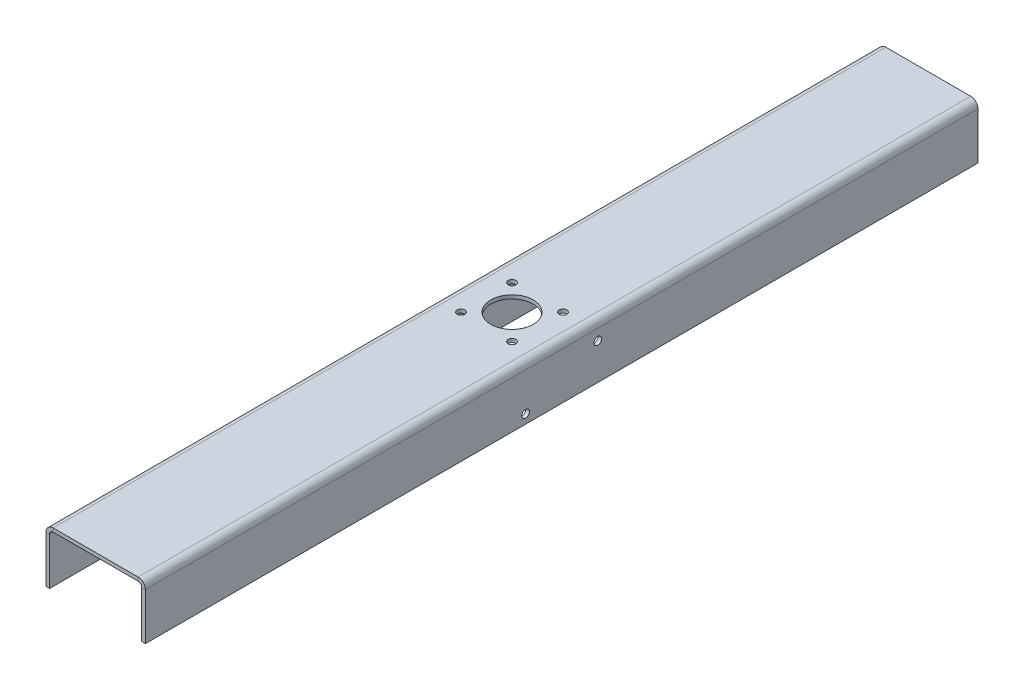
ISO-10303-21;
HEADER;
FILE_DESCRIPTION(('STEP AP214'),'2;1');
FILE_NAME('part.step','',(''),(''),'','','');
FILE_SCHEMA(('AUTOMOTIVE_DESIGN { 1 0 10303 214 1 1 1 1 }'));
ENDSEC;
DATA;
#1=APPLICATION_CONTEXT('core data for automotive mechanical design processes');
#2=APPLICATION_PROTOCOL_DEFINITION('international standard','automotive_design',2000,#1);
#3=PRODUCT_CONTEXT('',#1,'mechanical');
#4=PRODUCT('Part','Part','',(#3));
#5=PRODUCT_RELATED_PRODUCT_CATEGORY('part','',(#4));
#6=PRODUCT_DEFINITION_FORMATION('','',#4);
#7=PRODUCT_DEFINITION_CONTEXT('part definition',#1,'design');
#8=PRODUCT_DEFINITION('design','',#6,#7);
#9=PRODUCT_DEFINITION_SHAPE('','',#8);
#10=(LENGTH_UNIT() NAMED_UNIT(*) SI_UNIT(.MILLI.,.METRE.));
#11=(NAMED_UNIT(*) PLANE_ANGLE_UNIT() SI_UNIT($,.RADIAN.));
#12=(NAMED_UNIT(*) SI_UNIT($,.STERADIAN.) SOLID_ANGLE_UNIT());
#13=UNCERTAINTY_MEASURE_WITH_UNIT(LENGTH_MEASURE(1.E-05),#10,'distance_accuracy_value','');
#14=(GEOMETRIC_REPRESENTATION_CONTEXT(3) GLOBAL_UNCERTAINTY_ASSIGNED_CONTEXT((#13)) GLOBAL_UNIT_ASSIGNED_CONTEXT((#10,
#11,#12)) REPRESENTATION_CONTEXT('',''));
#15=CARTESIAN_POINT('',(0.,0.,0.));
#16=DIRECTION('',(0.,0.,1.));
#17=DIRECTION('',(1.,0.,0.));
#18=AXIS2_PLACEMENT_3D('',#15,#16,#17);
#19=CARTESIAN_POINT('',(55.,-7.99999999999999,461.));
#20=DIRECTION('',(0.,0.,1.));
#21=DIRECTION('',(1.,0.,0.));
#22=AXIS2_PLACEMENT_3D('',#19,#20,#21);
#23=PLANE('',#22);
#24=DIRECTION('',(-1.,0.,0.));
#25=VECTOR('',#24,1.);
#26=CARTESIAN_POINT('',(55.,-7.99999999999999,461.));
#27=LINE('',#26,#25);
#28=CARTESIAN_POINT('',(55.,-7.99999999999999,461.));
#29=VERTEX_POINT('',#28);
#30=CARTESIAN_POINT('',(51.,-7.99999999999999,461.));
#31=VERTEX_POINT('',#30);
#32=EDGE_CURVE('E11',#29,#31,#27,.T.);
#33=ORIENTED_EDGE('',*,*,#32,.F.);
#34=CARTESIAN_POINT('',(47.,-7.99999999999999,461.));
#35=DIRECTION('',(0.,0.,-1.));
#36=DIRECTION('',(-1.,0.,0.));
#37=AXIS2_PLACEMENT_3D('',#34,#35,#36);
#38=CIRCLE('',#37,8.);
#39=CARTESIAN_POINT('',(47.,0.,461.));
#40=VERTEX_POINT('',#39);
#41=EDGE_CURVE('E232',#29,#40,#38,.F.);
#42=ORIENTED_EDGE('',*,*,#41,.T.);
#43=DIRECTION('',(0.,1.,0.));
#44=VECTOR('',#43,1.);
#45=CARTESIAN_POINT('',(47.,-3.99999999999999,461.));
#46=LINE('',#45,#44);
#47=CARTESIAN_POINT('',(47.,-3.99999999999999,461.));
#48=VERTEX_POINT('',#47);
#49=EDGE_CURVE('E48',#48,#40,#46,.T.);
#50=ORIENTED_EDGE('',*,*,#49,.F.);
#51=CARTESIAN_POINT('',(47.,-7.99999999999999,461.));
#52=DIRECTION('',(0.,0.,1.));
#53=DIRECTION('',(1.,0.,0.));
#54=AXIS2_PLACEMENT_3D('',#51,#52,#53);
#55=CIRCLE('',#54,4.);
#56=EDGE_CURVE('E216',#31,#48,#55,.T.);
#57=ORIENTED_EDGE('',*,*,#56,.F.);
#58=EDGE_LOOP('',(#33,#42,#50,#57));
#59=FACE_BOUND('',#58,.T.);
#60=ADVANCED_FACE('F40',(#59),#23,.T.);
#61=CARTESIAN_POINT('',(47.,-3.99999999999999,461.));
#62=DIRECTION('',(0.,0.,1.));
#63=DIRECTION('',(1.,0.,0.));
#64=AXIS2_PLACEMENT_3D('',#61,#62,#63);
#65=PLANE('',#64);
#66=DIRECTION('',(0.,1.,0.));
#67=VECTOR('',#66,1.);
#68=CARTESIAN_POINT('',(55.,0.,461.));
#69=LINE('',#68,#67);
#70=CARTESIAN_POINT('',(55.,-60.,461.));
#71=VERTEX_POINT('',#70);
#72=EDGE_CURVE('E228',#71,#29,#69,.T.);
#73=ORIENTED_EDGE('',*,*,#72,.T.);
#74=ORIENTED_EDGE('',*,*,#32,.T.);
#75=DIRECTION('',(0.,1.,0.));
#76=VECTOR('',#75,1.);
#77=CARTESIAN_POINT('',(51.,0.,461.));
#78=LINE('',#77,#76);
#79=CARTESIAN_POINT('',(51.,-60.,461.));
#80=VERTEX_POINT('',#79);
#81=EDGE_CURVE('E220',#80,#31,#78,.T.);
#82=ORIENTED_EDGE('',*,*,#81,.F.);
#83=DIRECTION('',(-1.,0.,0.));
#84=VECTOR('',#83,1.);
#85=CARTESIAN_POINT('',(55.,-60.,461.));
#86=LINE('',#85,#84);
#87=EDGE_CURVE('E224',#71,#80,#86,.T.);
#88=ORIENTED_EDGE('',*,*,#87,.F.);
#89=EDGE_LOOP('',(#73,#74,#82,#88));
#90=FACE_BOUND('',#89,.T.);
#91=ADVANCED_FACE('F337',(#90),#65,.T.);
#92=CARTESIAN_POINT('',(47.,0.,-461.));
#93=DIRECTION('',(0.,0.,-1.));
#94=DIRECTION('',(-1.,0.,0.));
#95=AXIS2_PLACEMENT_3D('',#92,#93,#94);
#96=PLANE('',#95);
#97=DIRECTION('',(0.,-1.,0.));
#98=VECTOR('',#97,1.);
#99=CARTESIAN_POINT('',(47.,0.,-461.));
#100=LINE('',#99,#98);
#101=CARTESIAN_POINT('',(47.,0.,-461.));
#102=VERTEX_POINT('',#101);
#103=CARTESIAN_POINT('',(47.,-3.99999999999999,-461.));
#104=VERTEX_POINT('',#103);
#105=EDGE_CURVE('E292',#102,#104,#100,.T.);
#106=ORIENTED_EDGE('',*,*,#105,.F.);
#107=CARTESIAN_POINT('',(47.,-7.99999999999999,-461.));
#108=DIRECTION('',(0.,0.,-1.));
#109=DIRECTION('',(-1.,0.,0.));
#110=AXIS2_PLACEMENT_3D('',#107,#108,#109);
#111=CIRCLE('',#110,8.);
#112=CARTESIAN_POINT('',(55.,-7.99999999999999,-461.));
#113=VERTEX_POINT('',#112);
#114=EDGE_CURVE('E187',#113,#102,#111,.F.);
#115=ORIENTED_EDGE('',*,*,#114,.F.);
#116=DIRECTION('',(1.,0.,0.));
#117=VECTOR('',#116,1.);
#118=CARTESIAN_POINT('',(51.,-7.99999999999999,-461.));
#119=LINE('',#118,#117);
#120=CARTESIAN_POINT('',(51.,-7.99999999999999,-461.));
#121=VERTEX_POINT('',#120);
#122=EDGE_CURVE('E289',#121,#113,#119,.T.);
#123=ORIENTED_EDGE('',*,*,#122,.F.);
#124=CARTESIAN_POINT('',(47.,-7.99999999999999,-461.));
#125=DIRECTION('',(0.,0.,1.));
#126=DIRECTION('',(1.,0.,0.));
#127=AXIS2_PLACEMENT_3D('',#124,#125,#126);
#128=CIRCLE('',#127,4.);
#129=EDGE_CURVE('E171',#121,#104,#128,.T.);
#130=ORIENTED_EDGE('',*,*,#129,.T.);
#131=EDGE_LOOP('',(#106,#115,#123,#130));
#132=FACE_BOUND('',#131,.T.);
#133=ADVANCED_FACE('F347',(#132),#96,.T.);
#134=CARTESIAN_POINT('',(51.,-7.99999999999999,-461.));
#135=DIRECTION('',(0.,0.,-1.));
#136=DIRECTION('',(-1.,0.,0.));
#137=AXIS2_PLACEMENT_3D('',#134,#135,#136);
#138=PLANE('',#137);
#139=DIRECTION('',(-1.,0.,0.));
#140=VECTOR('',#139,1.);
#141=CARTESIAN_POINT('',(-55.,0.,-461.));
#142=LINE('',#141,#140);
#143=CARTESIAN_POINT('',(-47.,0.,-461.));
#144=VERTEX_POINT('',#143);
#145=EDGE_CURVE('E191',#102,#144,#142,.T.);
#146=ORIENTED_EDGE('',*,*,#145,.F.);
#147=ORIENTED_EDGE('',*,*,#105,.T.);
#148=DIRECTION('',(-1.,0.,0.));
#149=VECTOR('',#148,1.);
#150=CARTESIAN_POINT('',(-55.,-4.,-461.));
#151=LINE('',#150,#149);
#152=CARTESIAN_POINT('',(-47.,-4.,-461.));
#153=VERTEX_POINT('',#152);
#154=EDGE_CURVE('E167',#104,#153,#151,.T.);
#155=ORIENTED_EDGE('',*,*,#154,.T.);
#156=DIRECTION('',(0.,1.,0.));
#157=VECTOR('',#156,1.);
#158=CARTESIAN_POINT('',(-47.,-4.,-461.));
#159=LINE('',#158,#157);
#160=EDGE_CURVE('E140',#153,#144,#159,.T.);
#161=ORIENTED_EDGE('',*,*,#160,.T.);
#162=EDGE_LOOP('',(#146,#147,#155,#161));
#163=FACE_BOUND('',#162,.T.);
#164=ADVANCED_FACE('F349',(#163),#138,.T.);
#165=CARTESIAN_POINT('',(-47.,0.,461.));
#166=DIRECTION('',(0.,0.,1.));
#167=DIRECTION('',(1.,0.,0.));
#168=AXIS2_PLACEMENT_3D('',#165,#166,#167);
#169=PLANE('',#168);
#170=DIRECTION('',(0.,-1.,0.));
#171=VECTOR('',#170,1.);
#172=CARTESIAN_POINT('',(-47.,0.,461.));
#173=LINE('',#172,#171);
#174=CARTESIAN_POINT('',(-47.,0.,461.));
#175=VERTEX_POINT('',#174);
#176=CARTESIAN_POINT('',(-47.,-4.,461.));
#177=VERTEX_POINT('',#176);
#178=EDGE_CURVE('E62',#175,#177,#173,.T.);
#179=ORIENTED_EDGE('',*,*,#178,.F.);
#180=CARTESIAN_POINT('',(-47.,-8.,461.));
#181=DIRECTION('',(0.,0.,-1.));
#182=DIRECTION('',(-1.,0.,0.));
#183=AXIS2_PLACEMENT_3D('',#180,#181,#182);
#184=CIRCLE('',#183,8.);
#185=CARTESIAN_POINT('',(-55.,-8.,461.));
#186=VERTEX_POINT('',#185);
#187=EDGE_CURVE('E239',#175,#186,#184,.F.);
#188=ORIENTED_EDGE('',*,*,#187,.T.);
#189=DIRECTION('',(-1.,0.,0.));
#190=VECTOR('',#189,1.);
#191=CARTESIAN_POINT('',(-51.,-8.,461.));
#192=LINE('',#191,#190);
#193=CARTESIAN_POINT('',(-51.,-8.,461.));
#194=VERTEX_POINT('',#193);
#195=EDGE_CURVE('E55',#194,#186,#192,.T.);
#196=ORIENTED_EDGE('',*,*,#195,.F.);
#197=CARTESIAN_POINT('',(-47.,-8.,461.));
#198=DIRECTION('',(0.,0.,1.));
#199=DIRECTION('',(1.,0.,0.));
#200=AXIS2_PLACEMENT_3D('',#197,#198,#199);
#201=CIRCLE('',#200,4.);
#202=EDGE_CURVE('E208',#177,#194,#201,.T.);
#203=ORIENTED_EDGE('',*,*,#202,.F.);
#204=EDGE_LOOP('',(#179,#188,#196,#203));
#205=FACE_BOUND('',#204,.T.);
#206=ADVANCED_FACE('F315',(#205),#169,.T.);
#207=CARTESIAN_POINT('',(-51.,-8.,461.));
#208=DIRECTION('',(0.,0.,1.));
#209=DIRECTION('',(1.,0.,0.));
#210=AXIS2_PLACEMENT_3D('',#207,#208,#209);
#211=PLANE('',#210);
#212=DIRECTION('',(-1.,0.,0.));
#213=VECTOR('',#212,1.);
#214=CARTESIAN_POINT('',(-55.,0.,461.));
#215=LINE('',#214,#213);
#216=EDGE_CURVE('E236',#40,#175,#215,.T.);
#217=ORIENTED_EDGE('',*,*,#216,.T.);
#218=ORIENTED_EDGE('',*,*,#178,.T.);
#219=DIRECTION('',(-1.,0.,0.));
#220=VECTOR('',#219,1.);
#221=CARTESIAN_POINT('',(-55.,-4.,461.));
#222=LINE('',#221,#220);
#223=EDGE_CURVE('E212',#48,#177,#222,.T.);
#224=ORIENTED_EDGE('',*,*,#223,.F.);
#225=ORIENTED_EDGE('',*,*,#49,.T.);
#226=EDGE_LOOP('',(#217,#218,#224,#225));
#227=FACE_BOUND('',#226,.T.);
#228=ADVANCED_FACE('F297',(#227),#211,.T.);
#229=CARTESIAN_POINT('',(-55.,-8.,-461.));
#230=DIRECTION('',(0.,0.,-1.));
#231=DIRECTION('',(-1.,0.,0.));
#232=AXIS2_PLACEMENT_3D('',#229,#230,#231);
#233=PLANE('',#232);
#234=DIRECTION('',(1.,0.,0.));
#235=VECTOR('',#234,1.);
#236=CARTESIAN_POINT('',(-55.,-8.,-461.));
#237=LINE('',#236,#235);
#238=CARTESIAN_POINT('',(-55.,-8.,-461.));
#239=VERTEX_POINT('',#238);
#240=CARTESIAN_POINT('',(-51.,-8.,-461.));
#241=VERTEX_POINT('',#240);
#242=EDGE_CURVE('E282',#239,#241,#237,.T.);
#243=ORIENTED_EDGE('',*,*,#242,.F.);
#244=CARTESIAN_POINT('',(-47.,-8.,-461.));
#245=DIRECTION('',(0.,0.,-1.));
#246=DIRECTION('',(-1.,0.,0.));
#247=AXIS2_PLACEMENT_3D('',#244,#245,#246);
#248=CIRCLE('',#247,8.);
#249=EDGE_CURVE('E195',#144,#239,#248,.F.);
#250=ORIENTED_EDGE('',*,*,#249,.F.);
#251=ORIENTED_EDGE('',*,*,#160,.F.);
#252=CARTESIAN_POINT('',(-47.,-8.,-461.));
#253=DIRECTION('',(0.,0.,1.));
#254=DIRECTION('',(1.,0.,0.));
#255=AXIS2_PLACEMENT_3D('',#252,#253,#254);
#256=CIRCLE('',#255,4.);
#257=EDGE_CURVE('E160',#153,#241,#256,.T.);
#258=ORIENTED_EDGE('',*,*,#257,.T.);
#259=EDGE_LOOP('',(#243,#250,#251,#258));
#260=FACE_BOUND('',#259,.T.);
#261=ADVANCED_FACE('F351',(#260),#233,.T.);
#262=CARTESIAN_POINT('',(-47.,-4.,-461.));
#263=DIRECTION('',(0.,0.,-1.));
#264=DIRECTION('',(-1.,0.,0.));
#265=AXIS2_PLACEMENT_3D('',#262,#263,#264);
#266=PLANE('',#265);
#267=DIRECTION('',(0.,-1.,0.));
#268=VECTOR('',#267,1.);
#269=CARTESIAN_POINT('',(-55.,0.,-461.));
#270=LINE('',#269,#268);
#271=CARTESIAN_POINT('',(-55.,-60.,-461.));
#272=VERTEX_POINT('',#271);
#273=EDGE_CURVE('E145',#239,#272,#270,.T.);
#274=ORIENTED_EDGE('',*,*,#273,.F.);
#275=ORIENTED_EDGE('',*,*,#242,.T.);
#276=DIRECTION('',(0.,1.,0.));
#277=VECTOR('',#276,1.);
#278=CARTESIAN_POINT('',(-51.,0.,-461.));
#279=LINE('',#278,#277);
#280=CARTESIAN_POINT('',(-51.,-60.,-461.));
#281=VERTEX_POINT('',#280);
#282=EDGE_CURVE('E155',#241,#281,#279,.F.);
#283=ORIENTED_EDGE('',*,*,#282,.T.);
#284=DIRECTION('',(-1.,0.,0.));
#285=VECTOR('',#284,1.);
#286=CARTESIAN_POINT('',(-51.,-60.,-461.));
#287=LINE('',#286,#285);
#288=EDGE_CURVE('E133',#281,#272,#287,.T.);
#289=ORIENTED_EDGE('',*,*,#288,.T.);
#290=EDGE_LOOP('',(#274,#275,#283,#289));
#291=FACE_BOUND('',#290,.T.);
#292=ADVANCED_FACE('F153',(#291),#266,.T.);
#293=CARTESIAN_POINT('',(-55.,0.,461.));
#294=DIRECTION('',(1.,0.,0.));
#295=DIRECTION('',(0.,0.,-1.));
#296=AXIS2_PLACEMENT_3D('',#293,#294,#295);
#297=PLANE('',#296);
#298=CARTESIAN_POINT('',(-55.,-20.,-40.));
#299=DIRECTION('',(1.,0.,0.));
#300=DIRECTION('',(0.,1.,0.));
#301=AXIS2_PLACEMENT_3D('',#298,#299,#300);
#302=CIRCLE('',#301,4.25);
#303=CARTESIAN_POINT('',(-55.,-15.75,-40.));
#304=VERTEX_POINT('',#303);
#305=EDGE_CURVE('E721',#304,#304,#302,.T.);
#306=ORIENTED_EDGE('',*,*,#305,.T.);
#307=EDGE_LOOP('',(#306));
#308=FACE_BOUND('',#307,.T.);
#309=CARTESIAN_POINT('',(-55.,-50.,40.));
#310=DIRECTION('',(1.,0.,0.));
#311=DIRECTION('',(0.,1.,0.));
#312=AXIS2_PLACEMENT_3D('',#309,#310,#311);
#313=CIRCLE('',#312,4.25000000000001);
#314=CARTESIAN_POINT('',(-55.,-45.75,40.));
#315=VERTEX_POINT('',#314);
#316=EDGE_CURVE('E739',#315,#315,#313,.T.);
#317=ORIENTED_EDGE('',*,*,#316,.T.);
#318=EDGE_LOOP('',(#317));
#319=FACE_BOUND('',#318,.T.);
#320=ORIENTED_EDGE('',*,*,#273,.T.);
#321=DIRECTION('',(0.,0.,-1.));
#322=VECTOR('',#321,1.);
#323=CARTESIAN_POINT('',(-55.,-60.,461.));
#324=LINE('',#323,#322);
#325=CARTESIAN_POINT('',(-55.,-60.,461.));
#326=VERTEX_POINT('',#325);
#327=EDGE_CURVE('E129',#326,#272,#324,.T.);
#328=ORIENTED_EDGE('',*,*,#327,.F.);
#329=DIRECTION('',(0.,-1.,0.));
#330=VECTOR('',#329,1.);
#331=CARTESIAN_POINT('',(-55.,0.,461.));
#332=LINE('',#331,#330);
#333=EDGE_CURVE('E199',#186,#326,#332,.T.);
#334=ORIENTED_EDGE('',*,*,#333,.F.);
#335=DIRECTION('',(0.,0.,-1.));
#336=VECTOR('',#335,1.);
#337=CARTESIAN_POINT('',(-55.,-8.,461.));
#338=LINE('',#337,#336);
#339=EDGE_CURVE('E148',#186,#239,#338,.T.);
#340=ORIENTED_EDGE('',*,*,#339,.T.);
#341=EDGE_LOOP('',(#320,#328,#334,#340));
#342=FACE_BOUND('',#341,.T.);
#343=ADVANCED_FACE('F146',(#308,#319,#342),#297,.F.);
#344=CARTESIAN_POINT('',(-51.,-60.,461.));
#345=DIRECTION('',(0.,-1.,0.));
#346=DIRECTION('',(0.,0.,-1.));
#347=AXIS2_PLACEMENT_3D('',#344,#345,#346);
#348=PLANE('',#347);
#349=ORIENTED_EDGE('',*,*,#288,.F.);
#350=DIRECTION('',(0.,0.,-1.));
#351=VECTOR('',#350,1.);
#352=CARTESIAN_POINT('',(-51.,-60.,461.));
#353=LINE('',#352,#351);
#354=CARTESIAN_POINT('',(-51.,-60.,461.));
#355=VERTEX_POINT('',#354);
#356=EDGE_CURVE('E141',#355,#281,#353,.T.);
#357=ORIENTED_EDGE('',*,*,#356,.F.);
#358=DIRECTION('',(-1.,0.,0.));
#359=VECTOR('',#358,1.);
#360=CARTESIAN_POINT('',(-51.,-60.,461.));
#361=LINE('',#360,#359);
#362=EDGE_CURVE('E136',#355,#326,#361,.T.);
#363=ORIENTED_EDGE('',*,*,#362,.T.);
#364=ORIENTED_EDGE('',*,*,#327,.T.);
#365=EDGE_LOOP('',(#349,#357,#363,#364));
#366=FACE_BOUND('',#365,.T.);
#367=ADVANCED_FACE('F131',(#366),#348,.T.);
#368=CARTESIAN_POINT('',(-51.,0.,461.));
#369=DIRECTION('',(1.,0.,0.));
#370=DIRECTION('',(0.,0.,-1.));
#371=AXIS2_PLACEMENT_3D('',#368,#369,#370);
#372=PLANE('',#371);
#373=CARTESIAN_POINT('',(-51.,-20.,-40.));
#374=DIRECTION('',(1.,0.,0.));
#375=DIRECTION('',(0.,0.,-1.));
#376=AXIS2_PLACEMENT_3D('',#373,#374,#375);
#377=CIRCLE('',#376,4.25);
#378=CARTESIAN_POINT('',(-51.,-20.,-44.25));
#379=VERTEX_POINT('',#378);
#380=EDGE_CURVE('E718',#379,#379,#377,.T.);
#381=ORIENTED_EDGE('',*,*,#380,.F.);
#382=EDGE_LOOP('',(#381));
#383=FACE_BOUND('',#382,.T.);
#384=CARTESIAN_POINT('',(-51.,-50.,40.));
#385=DIRECTION('',(1.,0.,0.));
#386=DIRECTION('',(0.,0.,-1.));
#387=AXIS2_PLACEMENT_3D('',#384,#385,#386);
#388=CIRCLE('',#387,4.25000000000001);
#389=CARTESIAN_POINT('',(-51.,-50.,35.75));
#390=VERTEX_POINT('',#389);
#391=EDGE_CURVE('E747',#390,#390,#388,.T.);
#392=ORIENTED_EDGE('',*,*,#391,.F.);
#393=EDGE_LOOP('',(#392));
#394=FACE_BOUND('',#393,.T.);
#395=ORIENTED_EDGE('',*,*,#282,.F.);
#396=DIRECTION('',(0.,0.,-1.));
#397=VECTOR('',#396,1.);
#398=CARTESIAN_POINT('',(-51.,-8.,461.));
#399=LINE('',#398,#397);
#400=EDGE_CURVE('E274',#194,#241,#399,.T.);
#401=ORIENTED_EDGE('',*,*,#400,.F.);
#402=DIRECTION('',(0.,1.,0.));
#403=VECTOR('',#402,1.);
#404=CARTESIAN_POINT('',(-51.,0.,461.));
#405=LINE('',#404,#403);
#406=EDGE_CURVE('E204',#194,#355,#405,.F.);
#407=ORIENTED_EDGE('',*,*,#406,.T.);
#408=ORIENTED_EDGE('',*,*,#356,.T.);
#409=EDGE_LOOP('',(#395,#401,#407,#408));
#410=FACE_BOUND('',#409,.T.);
#411=ADVANCED_FACE('F318',(#383,#394,#410),#372,.T.);
#412=CARTESIAN_POINT('',(-47.,-8.,461.));
#413=DIRECTION('',(0.,0.,-1.));
#414=DIRECTION('',(-1.,0.,0.));
#415=AXIS2_PLACEMENT_3D('',#412,#413,#414);
#416=CYLINDRICAL_SURFACE('',#415,4.);
#417=ORIENTED_EDGE('',*,*,#257,.F.);
#418=DIRECTION('',(0.,0.,-1.));
#419=VECTOR('',#418,1.);
#420=CARTESIAN_POINT('',(-47.,-4.,461.));
#421=LINE('',#420,#419);
#422=EDGE_CURVE('E270',#177,#153,#421,.T.);
#423=ORIENTED_EDGE('',*,*,#422,.F.);
#424=ORIENTED_EDGE('',*,*,#202,.T.);
#425=ORIENTED_EDGE('',*,*,#400,.T.);
#426=EDGE_LOOP('',(#417,#423,#424,#425));
#427=FACE_BOUND('',#426,.T.);
#428=ADVANCED_FACE('F323',(#427),#416,.F.);
#429=CARTESIAN_POINT('',(-55.,-4.,461.));
#430=DIRECTION('',(0.,-1.,0.));
#431=DIRECTION('',(1.,0.,0.));
#432=AXIS2_PLACEMENT_3D('',#429,#430,#431);
#433=PLANE('',#432);
#434=CARTESIAN_POINT('',(-28.25,-4.,-28.2500000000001));
#435=DIRECTION('',(0.,-1.,0.));
#436=DIRECTION('',(1.,0.,0.));
#437=AXIS2_PLACEMENT_3D('',#434,#435,#436);
#438=CIRCLE('',#437,4.25);
#439=CARTESIAN_POINT('',(-24.,-4.,-28.2500000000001));
#440=VERTEX_POINT('',#439);
#441=EDGE_CURVE('E751',#440,#440,#438,.F.);
#442=ORIENTED_EDGE('',*,*,#441,.T.);
#443=EDGE_LOOP('',(#442));
#444=FACE_BOUND('',#443,.T.);
#445=CARTESIAN_POINT('',(-28.25,-4.,28.25));
#446=DIRECTION('',(0.,-1.,0.));
#447=DIRECTION('',(1.,0.,0.));
#448=AXIS2_PLACEMENT_3D('',#445,#446,#447);
#449=CIRCLE('',#448,4.25);
#450=CARTESIAN_POINT('',(-24.,-4.,28.25));
#451=VERTEX_POINT('',#450);
#452=EDGE_CURVE('E756',#451,#451,#449,.F.);
#453=ORIENTED_EDGE('',*,*,#452,.T.);
#454=EDGE_LOOP('',(#453));
#455=FACE_BOUND('',#454,.T.);
#456=CARTESIAN_POINT('',(28.25,-3.99999999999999,-28.25));
#457=DIRECTION('',(0.,-1.,0.));
#458=DIRECTION('',(1.,0.,0.));
#459=AXIS2_PLACEMENT_3D('',#456,#457,#458);
#460=CIRCLE('',#459,4.25000000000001);
#461=CARTESIAN_POINT('',(32.5,-3.99999999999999,-28.25));
#462=VERTEX_POINT('',#461);
#463=EDGE_CURVE('E763',#462,#462,#460,.F.);
#464=ORIENTED_EDGE('',*,*,#463,.T.);
#465=EDGE_LOOP('',(#464));
#466=FACE_BOUND('',#465,.T.);
#467=CARTESIAN_POINT('',(28.25,-3.99999999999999,28.25));
#468=DIRECTION('',(0.,-1.,0.));
#469=DIRECTION('',(1.,0.,0.));
#470=AXIS2_PLACEMENT_3D('',#467,#468,#469);
#471=CIRCLE('',#470,4.25);
#472=CARTESIAN_POINT('',(32.5,-3.99999999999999,28.25));
#473=VERTEX_POINT('',#472);
#474=EDGE_CURVE('E771',#473,#473,#471,.F.);
#475=ORIENTED_EDGE('',*,*,#474,.T.);
#476=EDGE_LOOP('',(#475));
#477=FACE_BOUND('',#476,.T.);
#478=CARTESIAN_POINT('',(0.,-3.99999999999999,0.));
#479=DIRECTION('',(0.,-1.,0.));
#480=DIRECTION('',(1.,0.,0.));
#481=AXIS2_PLACEMENT_3D('',#478,#479,#480);
#482=CIRCLE('',#481,23.5);
#483=CARTESIAN_POINT('',(23.5,-3.99999999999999,0.));
#484=VERTEX_POINT('',#483);
#485=EDGE_CURVE('E779',#484,#484,#482,.F.);
#486=ORIENTED_EDGE('',*,*,#485,.T.);
#487=EDGE_LOOP('',(#486));
#488=FACE_BOUND('',#487,.T.);
#489=ORIENTED_EDGE('',*,*,#154,.F.);
#490=DIRECTION('',(0.,0.,-1.));
#491=VECTOR('',#490,1.);
#492=CARTESIAN_POINT('',(47.,-3.99999999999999,461.));
#493=LINE('',#492,#491);
#494=EDGE_CURVE('E266',#48,#104,#493,.T.);
#495=ORIENTED_EDGE('',*,*,#494,.F.);
#496=ORIENTED_EDGE('',*,*,#223,.T.);
#497=ORIENTED_EDGE('',*,*,#422,.T.);
#498=EDGE_LOOP('',(#489,#495,#496,#497));
#499=FACE_BOUND('',#498,.T.);
#500=ADVANCED_FACE('F326',(#444,#455,#466,#477,#488,#499),#433,.T.);
#501=CARTESIAN_POINT('',(47.,-7.99999999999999,461.));
#502=DIRECTION('',(0.,0.,-1.));
#503=DIRECTION('',(-1.,0.,0.));
#504=AXIS2_PLACEMENT_3D('',#501,#502,#503);
#505=CYLINDRICAL_SURFACE('',#504,4.);
#506=ORIENTED_EDGE('',*,*,#129,.F.);
#507=DIRECTION('',(0.,0.,-1.));
#508=VECTOR('',#507,1.);
#509=CARTESIAN_POINT('',(51.,-7.99999999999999,461.));
#510=LINE('',#509,#508);
#511=EDGE_CURVE('E262',#31,#121,#510,.T.);
#512=ORIENTED_EDGE('',*,*,#511,.F.);
#513=ORIENTED_EDGE('',*,*,#56,.T.);
#514=ORIENTED_EDGE('',*,*,#494,.T.);
#515=EDGE_LOOP('',(#506,#512,#513,#514));
#516=FACE_BOUND('',#515,.T.);
#517=ADVANCED_FACE('F329',(#516),#505,.F.);
#518=CARTESIAN_POINT('',(51.,0.,461.));
#519=DIRECTION('',(-1.,0.,0.));
#520=DIRECTION('',(0.,-1.,0.));
#521=AXIS2_PLACEMENT_3D('',#518,#519,#520);
#522=PLANE('',#521);
#523=CARTESIAN_POINT('',(51.,-20.,-40.));
#524=DIRECTION('',(-1.,0.,0.));
#525=DIRECTION('',(0.,-1.,0.));
#526=AXIS2_PLACEMENT_3D('',#523,#524,#525);
#527=CIRCLE('',#526,4.25);
#528=CARTESIAN_POINT('',(51.,-24.25,-40.));
#529=VERTEX_POINT('',#528);
#530=EDGE_CURVE('E723',#529,#529,#527,.T.);
#531=ORIENTED_EDGE('',*,*,#530,.F.);
#532=EDGE_LOOP('',(#531));
#533=FACE_BOUND('',#532,.T.);
#534=CARTESIAN_POINT('',(51.,-50.,40.));
#535=DIRECTION('',(-1.,0.,0.));
#536=DIRECTION('',(0.,-1.,0.));
#537=AXIS2_PLACEMENT_3D('',#534,#535,#536);
#538=CIRCLE('',#537,4.25000000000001);
#539=CARTESIAN_POINT('',(51.,-54.25,40.));
#540=VERTEX_POINT('',#539);
#541=EDGE_CURVE('E743',#540,#540,#538,.T.);
#542=ORIENTED_EDGE('',*,*,#541,.F.);
#543=EDGE_LOOP('',(#542));
#544=FACE_BOUND('',#543,.T.);
#545=DIRECTION('',(0.,1.,0.));
#546=VECTOR('',#545,1.);
#547=CARTESIAN_POINT('',(51.,0.,-461.));
#548=LINE('',#547,#546);
#549=CARTESIAN_POINT('',(51.,-60.,-461.));
#550=VERTEX_POINT('',#549);
#551=EDGE_CURVE('E175',#550,#121,#548,.T.);
#552=ORIENTED_EDGE('',*,*,#551,.F.);
#553=DIRECTION('',(0.,0.,-1.));
#554=VECTOR('',#553,1.);
#555=CARTESIAN_POINT('',(51.,-60.,461.));
#556=LINE('',#555,#554);
#557=EDGE_CURVE('E259',#80,#550,#556,.T.);
#558=ORIENTED_EDGE('',*,*,#557,.F.);
#559=ORIENTED_EDGE('',*,*,#81,.T.);
#560=ORIENTED_EDGE('',*,*,#511,.T.);
#561=EDGE_LOOP('',(#552,#558,#559,#560));
#562=FACE_BOUND('',#561,.T.);
#563=ADVANCED_FACE('F334',(#533,#544,#562),#522,.T.);
#564=CARTESIAN_POINT('',(55.,-60.,461.));
#565=DIRECTION('',(0.,-1.,0.));
#566=DIRECTION('',(0.,0.,-1.));
#567=AXIS2_PLACEMENT_3D('',#564,#565,#566);
#568=PLANE('',#567);
#569=DIRECTION('',(-1.,0.,0.));
#570=VECTOR('',#569,1.);
#571=CARTESIAN_POINT('',(55.,-60.,-461.));
#572=LINE('',#571,#570);
#573=CARTESIAN_POINT('',(55.,-60.,-461.));
#574=VERTEX_POINT('',#573);
#575=EDGE_CURVE('E179',#574,#550,#572,.T.);
#576=ORIENTED_EDGE('',*,*,#575,.F.);
#577=DIRECTION('',(0.,0.,-1.));
#578=VECTOR('',#577,1.);
#579=CARTESIAN_POINT('',(55.,-60.,461.));
#580=LINE('',#579,#578);
#581=EDGE_CURVE('E256',#71,#574,#580,.T.);
#582=ORIENTED_EDGE('',*,*,#581,.F.);
#583=ORIENTED_EDGE('',*,*,#87,.T.);
#584=ORIENTED_EDGE('',*,*,#557,.T.);
#585=EDGE_LOOP('',(#576,#582,#583,#584));
#586=FACE_BOUND('',#585,.T.);
#587=ADVANCED_FACE('F340',(#586),#568,.T.);
#588=CARTESIAN_POINT('',(55.,0.,461.));
#589=DIRECTION('',(-1.,0.,0.));
#590=DIRECTION('',(0.,-1.,0.));
#591=AXIS2_PLACEMENT_3D('',#588,#589,#590);
#592=PLANE('',#591);
#593=CARTESIAN_POINT('',(55.,-20.,-40.));
#594=DIRECTION('',(1.,0.,0.));
#595=DIRECTION('',(0.,1.,0.));
#596=AXIS2_PLACEMENT_3D('',#593,#594,#595);
#597=CIRCLE('',#596,4.25);
#598=CARTESIAN_POINT('',(55.,-15.75,-40.));
#599=VERTEX_POINT('',#598);
#600=EDGE_CURVE('E724',#599,#599,#597,.T.);
#601=ORIENTED_EDGE('',*,*,#600,.F.);
#602=EDGE_LOOP('',(#601));
#603=FACE_BOUND('',#602,.T.);
#604=CARTESIAN_POINT('',(55.,-50.,40.));
#605=DIRECTION('',(1.,0.,0.));
#606=DIRECTION('',(0.,1.,0.));
#607=AXIS2_PLACEMENT_3D('',#604,#605,#606);
#608=CIRCLE('',#607,4.25000000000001);
#609=CARTESIAN_POINT('',(55.,-45.75,40.));
#610=VERTEX_POINT('',#609);
#611=EDGE_CURVE('E735',#610,#610,#608,.T.);
#612=ORIENTED_EDGE('',*,*,#611,.F.);
#613=EDGE_LOOP('',(#612));
#614=FACE_BOUND('',#613,.T.);
#615=DIRECTION('',(0.,1.,0.));
#616=VECTOR('',#615,1.);
#617=CARTESIAN_POINT('',(55.,0.,-461.));
#618=LINE('',#617,#616);
#619=EDGE_CURVE('E183',#574,#113,#618,.T.);
#620=ORIENTED_EDGE('',*,*,#619,.T.);
#621=DIRECTION('',(0.,0.,-1.));
#622=VECTOR('',#621,1.);
#623=CARTESIAN_POINT('',(55.,-7.99999999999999,461.));
#624=LINE('',#623,#622);
#625=EDGE_CURVE('E252',#29,#113,#624,.T.);
#626=ORIENTED_EDGE('',*,*,#625,.F.);
#627=ORIENTED_EDGE('',*,*,#72,.F.);
#628=ORIENTED_EDGE('',*,*,#581,.T.);
#629=EDGE_LOOP('',(#620,#626,#627,#628));
#630=FACE_BOUND('',#629,.T.);
#631=ADVANCED_FACE('F345',(#603,#614,#630),#592,.F.);
#632=CARTESIAN_POINT('',(47.,-7.99999999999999,461.));
#633=DIRECTION('',(0.,0.,-1.));
#634=DIRECTION('',(-1.,0.,0.));
#635=AXIS2_PLACEMENT_3D('',#632,#633,#634);
#636=CYLINDRICAL_SURFACE('',#635,8.);
#637=ORIENTED_EDGE('',*,*,#114,.T.);
#638=DIRECTION('',(0.,0.,-1.));
#639=VECTOR('',#638,1.);
#640=CARTESIAN_POINT('',(47.,0.,461.));
#641=LINE('',#640,#639);
#642=EDGE_CURVE('E248',#40,#102,#641,.T.);
#643=ORIENTED_EDGE('',*,*,#642,.F.);
#644=ORIENTED_EDGE('',*,*,#41,.F.);
#645=ORIENTED_EDGE('',*,*,#625,.T.);
#646=EDGE_LOOP('',(#637,#643,#644,#645));
#647=FACE_BOUND('',#646,.T.);
#648=ADVANCED_FACE('F306',(#647),#636,.T.);
#649=CARTESIAN_POINT('',(-55.,0.,461.));
#650=DIRECTION('',(0.,-1.,0.));
#651=DIRECTION('',(1.,0.,0.));
#652=AXIS2_PLACEMENT_3D('',#649,#650,#651);
#653=PLANE('',#652);
#654=CARTESIAN_POINT('',(-28.25,0.,-28.2500000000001));
#655=DIRECTION('',(0.,1.,0.));
#656=DIRECTION('',(-1.,0.,0.));
#657=AXIS2_PLACEMENT_3D('',#654,#655,#656);
#658=CIRCLE('',#657,4.25);
#659=CARTESIAN_POINT('',(-32.5,0.,-28.2500000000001));
#660=VERTEX_POINT('',#659);
#661=EDGE_CURVE('E752',#660,#660,#658,.T.);
#662=ORIENTED_EDGE('',*,*,#661,.F.);
#663=EDGE_LOOP('',(#662));
#664=FACE_BOUND('',#663,.T.);
#665=CARTESIAN_POINT('',(-28.25,0.,28.25));
#666=DIRECTION('',(0.,1.,0.));
#667=DIRECTION('',(-1.,0.,0.));
#668=AXIS2_PLACEMENT_3D('',#665,#666,#667);
#669=CIRCLE('',#668,4.25);
#670=CARTESIAN_POINT('',(-32.5,0.,28.25));
#671=VERTEX_POINT('',#670);
#672=EDGE_CURVE('E760',#671,#671,#669,.T.);
#673=ORIENTED_EDGE('',*,*,#672,.F.);
#674=EDGE_LOOP('',(#673));
#675=FACE_BOUND('',#674,.T.);
#676=CARTESIAN_POINT('',(28.25,0.,-28.25));
#677=DIRECTION('',(0.,1.,0.));
#678=DIRECTION('',(-1.,0.,0.));
#679=AXIS2_PLACEMENT_3D('',#676,#677,#678);
#680=CIRCLE('',#679,4.25000000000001);
#681=CARTESIAN_POINT('',(24.,0.,-28.25));
#682=VERTEX_POINT('',#681);
#683=EDGE_CURVE('E767',#682,#682,#680,.T.);
#684=ORIENTED_EDGE('',*,*,#683,.F.);
#685=EDGE_LOOP('',(#684));
#686=FACE_BOUND('',#685,.T.);
#687=CARTESIAN_POINT('',(28.25,0.,28.25));
#688=DIRECTION('',(0.,1.,0.));
#689=DIRECTION('',(-1.,0.,0.));
#690=AXIS2_PLACEMENT_3D('',#687,#688,#689);
#691=CIRCLE('',#690,4.25);
#692=CARTESIAN_POINT('',(24.,0.,28.25));
#693=VERTEX_POINT('',#692);
#694=EDGE_CURVE('E775',#693,#693,#691,.T.);
#695=ORIENTED_EDGE('',*,*,#694,.F.);
#696=EDGE_LOOP('',(#695));
#697=FACE_BOUND('',#696,.T.);
#698=CARTESIAN_POINT('',(0.,0.,0.));
#699=DIRECTION('',(0.,1.,0.));
#700=DIRECTION('',(-1.,0.,0.));
#701=AXIS2_PLACEMENT_3D('',#698,#699,#700);
#702=CIRCLE('',#701,23.5);
#703=CARTESIAN_POINT('',(-23.5,0.,0.));
#704=VERTEX_POINT('',#703);
#705=EDGE_CURVE('E151',#704,#704,#702,.T.);
#706=ORIENTED_EDGE('',*,*,#705,.F.);
#707=EDGE_LOOP('',(#706));
#708=FACE_BOUND('',#707,.T.);
#709=ORIENTED_EDGE('',*,*,#145,.T.);
#710=DIRECTION('',(0.,0.,-1.));
#711=VECTOR('',#710,1.);
#712=CARTESIAN_POINT('',(-47.,0.,461.));
#713=LINE('',#712,#711);
#714=EDGE_CURVE('E244',#175,#144,#713,.T.);
#715=ORIENTED_EDGE('',*,*,#714,.F.);
#716=ORIENTED_EDGE('',*,*,#216,.F.);
#717=ORIENTED_EDGE('',*,*,#642,.T.);
#718=EDGE_LOOP('',(#709,#715,#716,#717));
#719=FACE_BOUND('',#718,.T.);
#720=ADVANCED_FACE('F310',(#664,#675,#686,#697,#708,#719),#653,.F.);
#721=CARTESIAN_POINT('',(-47.,-8.,461.));
#722=DIRECTION('',(0.,0.,-1.));
#723=DIRECTION('',(-1.,0.,0.));
#724=AXIS2_PLACEMENT_3D('',#721,#722,#723);
#725=CYLINDRICAL_SURFACE('',#724,8.);
#726=ORIENTED_EDGE('',*,*,#249,.T.);
#727=ORIENTED_EDGE('',*,*,#339,.F.);
#728=ORIENTED_EDGE('',*,*,#187,.F.);
#729=ORIENTED_EDGE('',*,*,#714,.T.);
#730=EDGE_LOOP('',(#726,#727,#728,#729));
#731=FACE_BOUND('',#730,.T.);
#732=ADVANCED_FACE('F314',(#731),#725,.T.);
#733=CARTESIAN_POINT('',(-47.,-8.,461.));
#734=DIRECTION('',(0.,0.,1.));
#735=DIRECTION('',(1.,0.,0.));
#736=AXIS2_PLACEMENT_3D('',#733,#734,#735);
#737=PLANE('',#736);
#738=ORIENTED_EDGE('',*,*,#333,.T.);
#739=ORIENTED_EDGE('',*,*,#362,.F.);
#740=ORIENTED_EDGE('',*,*,#406,.F.);
#741=ORIENTED_EDGE('',*,*,#195,.T.);
#742=EDGE_LOOP('',(#738,#739,#740,#741));
#743=FACE_BOUND('',#742,.T.);
#744=ADVANCED_FACE('F321',(#743),#737,.T.);
#745=CARTESIAN_POINT('',(-47.,-8.,-461.));
#746=DIRECTION('',(0.,0.,1.));
#747=DIRECTION('',(1.,0.,0.));
#748=AXIS2_PLACEMENT_3D('',#745,#746,#747);
#749=PLANE('',#748);
#750=ORIENTED_EDGE('',*,*,#551,.T.);
#751=ORIENTED_EDGE('',*,*,#122,.T.);
#752=ORIENTED_EDGE('',*,*,#619,.F.);
#753=ORIENTED_EDGE('',*,*,#575,.T.);
#754=EDGE_LOOP('',(#750,#751,#752,#753));
#755=FACE_BOUND('',#754,.T.);
#756=ADVANCED_FACE('F488',(#755),#749,.F.);
#757=CARTESIAN_POINT('',(0.,-60.001,0.));
#758=DIRECTION('',(0.,1.,0.));
#759=DIRECTION('',(-1.,0.,0.));
#760=AXIS2_PLACEMENT_3D('',#757,#758,#759);
#761=CYLINDRICAL_SURFACE('',#760,23.5);
#762=ORIENTED_EDGE('',*,*,#485,.F.);
#763=EDGE_LOOP('',(#762));
#764=FACE_BOUND('',#763,.T.);
#765=ORIENTED_EDGE('',*,*,#705,.T.);
#766=EDGE_LOOP('',(#765));
#767=FACE_BOUND('',#766,.T.);
#768=ADVANCED_FACE('F495',(#764,#767),#761,.F.);
#769=CARTESIAN_POINT('',(28.25,-60.001,28.25));
#770=DIRECTION('',(0.,1.,0.));
#771=DIRECTION('',(-1.,0.,0.));
#772=AXIS2_PLACEMENT_3D('',#769,#770,#771);
#773=CYLINDRICAL_SURFACE('',#772,4.25);
#774=ORIENTED_EDGE('',*,*,#474,.F.);
#775=EDGE_LOOP('',(#774));
#776=FACE_BOUND('',#775,.T.);
#777=ORIENTED_EDGE('',*,*,#694,.T.);
#778=EDGE_LOOP('',(#777));
#779=FACE_BOUND('',#778,.T.);
#780=ADVANCED_FACE('F503',(#776,#779),#773,.F.);
#781=CARTESIAN_POINT('',(28.25,-60.001,-28.25));
#782=DIRECTION('',(0.,1.,0.));
#783=DIRECTION('',(-1.,0.,0.));
#784=AXIS2_PLACEMENT_3D('',#781,#782,#783);
#785=CYLINDRICAL_SURFACE('',#784,4.25000000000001);
#786=ORIENTED_EDGE('',*,*,#463,.F.);
#787=EDGE_LOOP('',(#786));
#788=FACE_BOUND('',#787,.T.);
#789=ORIENTED_EDGE('',*,*,#683,.T.);
#790=EDGE_LOOP('',(#789));
#791=FACE_BOUND('',#790,.T.);
#792=ADVANCED_FACE('F512',(#788,#791),#785,.F.);
#793=CARTESIAN_POINT('',(-28.25,-60.001,28.25));
#794=DIRECTION('',(0.,1.,0.));
#795=DIRECTION('',(-1.,0.,0.));
#796=AXIS2_PLACEMENT_3D('',#793,#794,#795);
#797=CYLINDRICAL_SURFACE('',#796,4.25);
#798=ORIENTED_EDGE('',*,*,#452,.F.);
#799=EDGE_LOOP('',(#798));
#800=FACE_BOUND('',#799,.T.);
#801=ORIENTED_EDGE('',*,*,#672,.T.);
#802=EDGE_LOOP('',(#801));
#803=FACE_BOUND('',#802,.T.);
#804=ADVANCED_FACE('F521',(#800,#803),#797,.F.);
#805=CARTESIAN_POINT('',(-28.25,-60.001,-28.2500000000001));
#806=DIRECTION('',(0.,1.,0.));
#807=DIRECTION('',(-1.,0.,0.));
#808=AXIS2_PLACEMENT_3D('',#805,#806,#807);
#809=CYLINDRICAL_SURFACE('',#808,4.25);
#810=ORIENTED_EDGE('',*,*,#441,.F.);
#811=EDGE_LOOP('',(#810));
#812=FACE_BOUND('',#811,.T.);
#813=ORIENTED_EDGE('',*,*,#661,.T.);
#814=EDGE_LOOP('',(#813));
#815=FACE_BOUND('',#814,.T.);
#816=ADVANCED_FACE('F530',(#812,#815),#809,.F.);
#817=CARTESIAN_POINT('',(-55.,-50.,40.));
#818=DIRECTION('',(1.,0.,0.));
#819=DIRECTION('',(0.,1.,0.));
#820=AXIS2_PLACEMENT_3D('',#817,#818,#819);
#821=CYLINDRICAL_SURFACE('',#820,4.25000000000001);
#822=ORIENTED_EDGE('',*,*,#541,.T.);
#823=EDGE_LOOP('',(#822));
#824=FACE_BOUND('',#823,.T.);
#825=ORIENTED_EDGE('',*,*,#611,.T.);
#826=EDGE_LOOP('',(#825));
#827=FACE_BOUND('',#826,.T.);
#828=ADVANCED_FACE('F538',(#824,#827),#821,.F.);
#829=ORIENTED_EDGE('',*,*,#391,.T.);
#830=EDGE_LOOP('',(#829));
#831=FACE_BOUND('',#830,.T.);
#832=ORIENTED_EDGE('',*,*,#316,.F.);
#833=EDGE_LOOP('',(#832));
#834=FACE_BOUND('',#833,.T.);
#835=ADVANCED_FACE('F546',(#831,#834),#821,.F.);
#836=CARTESIAN_POINT('',(-55.,-20.,-40.));
#837=DIRECTION('',(1.,0.,0.));
#838=DIRECTION('',(0.,1.,0.));
#839=AXIS2_PLACEMENT_3D('',#836,#837,#838);
#840=CYLINDRICAL_SURFACE('',#839,4.25);
#841=ORIENTED_EDGE('',*,*,#530,.T.);
#842=EDGE_LOOP('',(#841));
#843=FACE_BOUND('',#842,.T.);
#844=ORIENTED_EDGE('',*,*,#600,.T.);
#845=EDGE_LOOP('',(#844));
#846=FACE_BOUND('',#845,.T.);
#847=ADVANCED_FACE('F555',(#843,#846),#840,.F.);
#848=ORIENTED_EDGE('',*,*,#380,.T.);
#849=EDGE_LOOP('',(#848));
#850=FACE_BOUND('',#849,.T.);
#851=ORIENTED_EDGE('',*,*,#305,.F.);
#852=EDGE_LOOP('',(#851));
#853=FACE_BOUND('',#852,.T.);
#854=ADVANCED_FACE('F563',(#850,#853),#840,.F.);
#855=CLOSED_SHELL('',(#60,#91,#133,#164,#206,#228,#261,#292,#343,#367,#411,#428,#500,#517,#563,
#587,#631,#648,#720,#732,#744,#756,#768,#780,#792,#804,#816,#828,#835,#847,#854));
#856=MANIFOLD_SOLID_BREP('B2',#855);
#857=ADVANCED_BREP_SHAPE_REPRESENTATION('',(#18,#856),#14);
#858=SHAPE_DEFINITION_REPRESENTATION(#9,#857);
ENDSEC;
END-ISO-10303-21;
